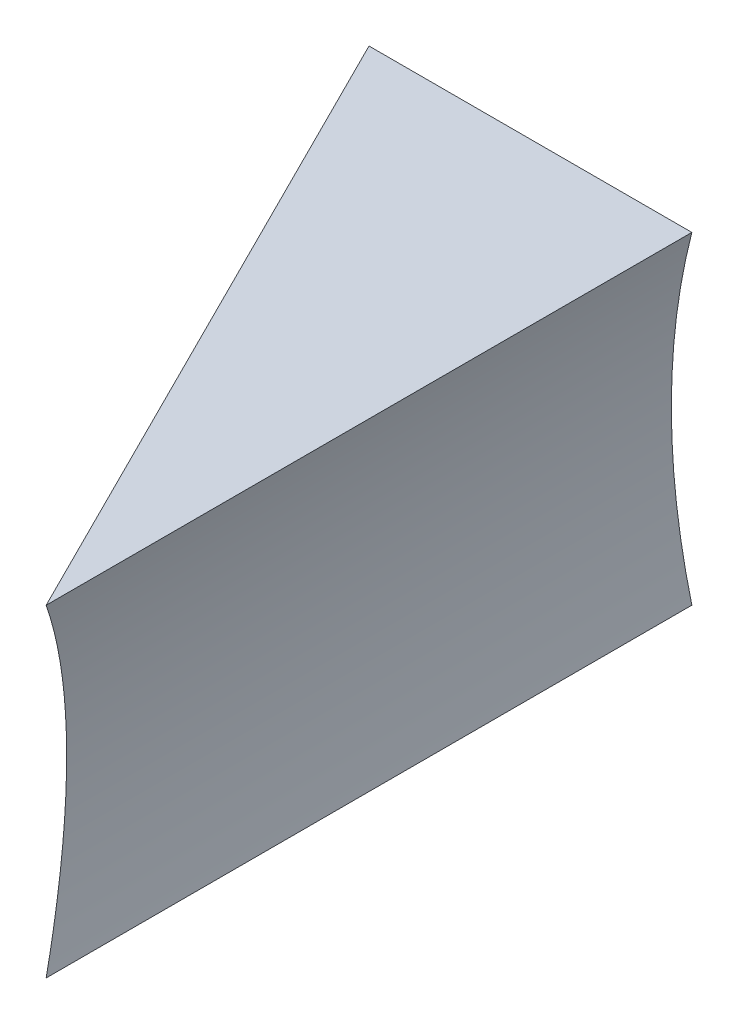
from build123d import *

# Parameters (mm, degrees)
EXTRUDE_1_DEPTH     = 50
SKETCH_2_OUTSIDE_W  = 68.802
SKETCH_2_OUTSIDE_H  = 67.214
CUT_EXTRUDE_1_DEPTH = 30


with BuildPart() as part:
    # Sketch 1 → Extrude 1 (new body)
    with BuildSketch(Plane.XY):
        with BuildLine():
            Line((-100, 12.5), (-100, -12.5))
            Line((-100, -12.5), (-48.412291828, -12.5))
            ThreePointArc((-48.412291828, -12.5), (-50, 0), (-48.412291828, 12.5))
            Line((-48.412291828, 12.5), (-100, 12.5))
        make_face()
    extrude(amount=EXTRUDE_1_DEPTH)

    # Sketch 2 outside → Cut-Extrude 1 (cut, symmetric)
    with BuildSketch(Plane(origin=(0, 0, 0), x_dir=(1, 0, 0), z_dir=(0, 1, 0))):
        with Locations((-74.206, -25)):
            Rectangle(SKETCH_2_OUTSIDE_W, SKETCH_2_OUTSIDE_H)
        Polygon((-48.412291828, -50), (-73.412291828, 0), (-48.412291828, 0), align=None, mode=Mode.SUBTRACT)
    extrude(amount=CUT_EXTRUDE_1_DEPTH, both=True, mode=Mode.SUBTRACT)


solid = part.part
